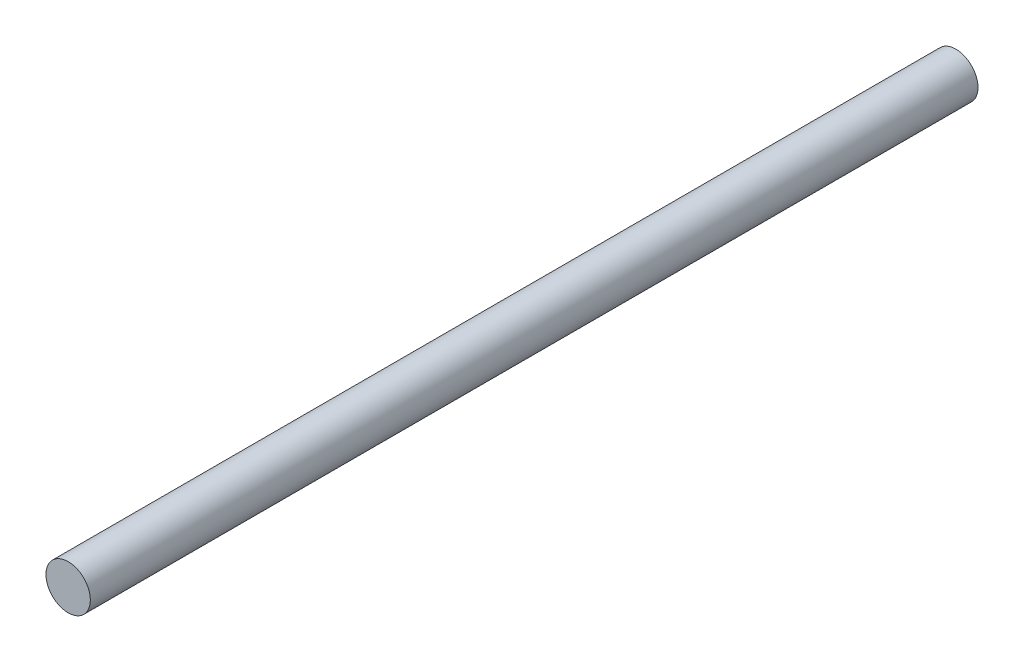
from build123d import *

# Parameters (mm, degrees)
ESQUISSE1_R               = 5
BASE_EXTRUSION_DEPTH      = 200
TROU_TARAUD_M6X1_01_D     = 5
TROU_TARAUD_M6X1_01_DEPTH = 17
TROU_TARAUD_M6X1_01_TIP   = 1.502151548


with BuildPart() as part:
    # Esquisse1 → Base-Extrusion (new body)
    with BuildSketch(Plane.XY):
        Circle(ESQUISSE1_R)
    extrude(amount=BASE_EXTRUSION_DEPTH)

    # Trou taraud_ M6x1.01
    with Locations(Plane(origin=(0, 0, 0), x_dir=(-1, 0, 0), z_dir=(0, 0, -1))):
        with Locations((0, 0)):
            Hole(TROU_TARAUD_M6X1_01_D / 2, depth=TROU_TARAUD_M6X1_01_DEPTH)
            with Locations((0, 0, -(TROU_TARAUD_M6X1_01_DEPTH + TROU_TARAUD_M6X1_01_TIP / 2))):  # 118° drill point
                Cone(0, TROU_TARAUD_M6X1_01_D / 2, TROU_TARAUD_M6X1_01_TIP, mode=Mode.SUBTRACT)


solid = part.part
